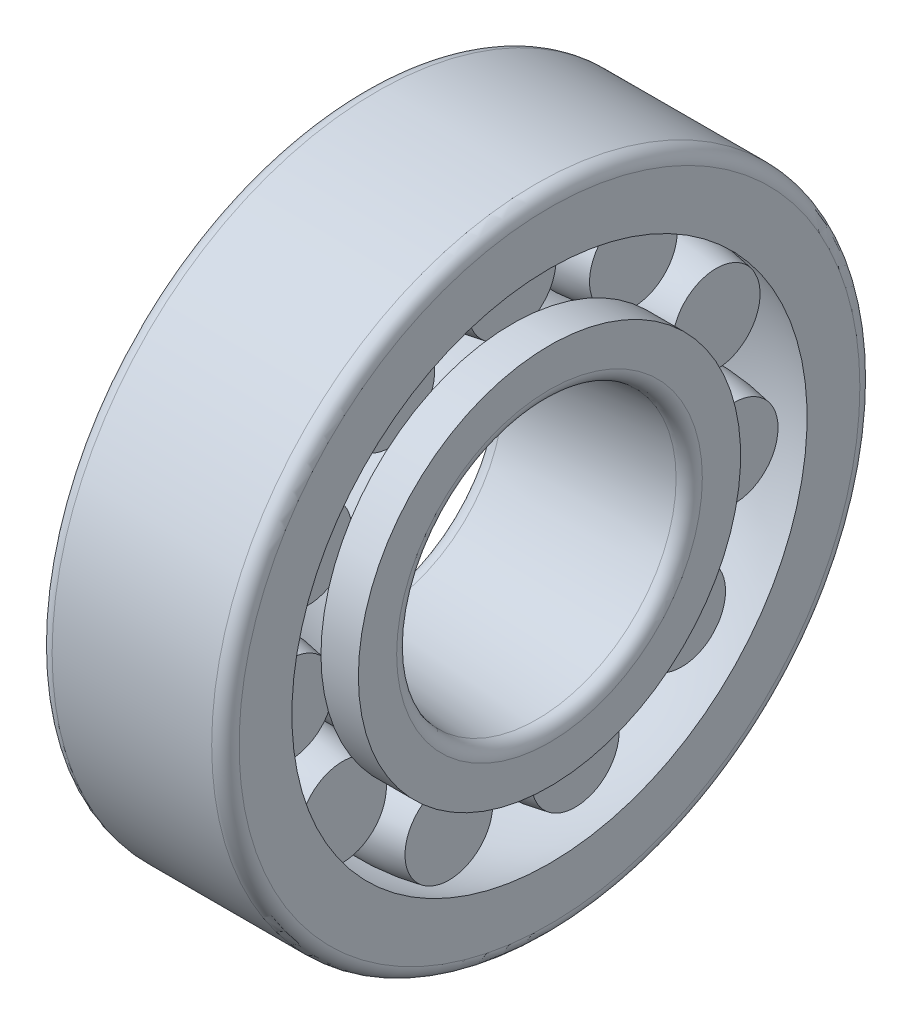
ISO-10303-21;
HEADER;
FILE_DESCRIPTION(('STEP AP214'),'2;1');
FILE_NAME('part.step','',(''),(''),'','','');
FILE_SCHEMA(('AUTOMOTIVE_DESIGN { 1 0 10303 214 1 1 1 1 }'));
ENDSEC;
DATA;
#1=APPLICATION_CONTEXT('core data for automotive mechanical design processes');
#2=APPLICATION_PROTOCOL_DEFINITION('international standard','automotive_design',2000,#1);
#3=PRODUCT_CONTEXT('',#1,'mechanical');
#4=PRODUCT('Part','Part','',(#3));
#5=PRODUCT_RELATED_PRODUCT_CATEGORY('part','',(#4));
#6=PRODUCT_DEFINITION_FORMATION('','',#4);
#7=PRODUCT_DEFINITION_CONTEXT('part definition',#1,'design');
#8=PRODUCT_DEFINITION('design','',#6,#7);
#9=PRODUCT_DEFINITION_SHAPE('','',#8);
#10=(LENGTH_UNIT() NAMED_UNIT(*) SI_UNIT(.MILLI.,.METRE.));
#11=(NAMED_UNIT(*) PLANE_ANGLE_UNIT() SI_UNIT($,.RADIAN.));
#12=(NAMED_UNIT(*) SI_UNIT($,.STERADIAN.) SOLID_ANGLE_UNIT());
#13=UNCERTAINTY_MEASURE_WITH_UNIT(LENGTH_MEASURE(1.E-05),#10,'distance_accuracy_value','');
#14=(GEOMETRIC_REPRESENTATION_CONTEXT(3) GLOBAL_UNCERTAINTY_ASSIGNED_CONTEXT((#13)) GLOBAL_UNIT_ASSIGNED_CONTEXT((#10,
#11,#12)) REPRESENTATION_CONTEXT('',''));
#15=CARTESIAN_POINT('',(0.,0.,0.));
#16=DIRECTION('',(0.,0.,1.));
#17=DIRECTION('',(1.,0.,0.));
#18=AXIS2_PLACEMENT_3D('',#15,#16,#17);
#19=CARTESIAN_POINT('',(3.00000000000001,12.1813372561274,-7.82847010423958));
#20=DIRECTION('',(1.,0.,0.));
#21=DIRECTION('',(0.,0.841253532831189,-0.540640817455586));
#22=AXIS2_PLACEMENT_3D('',#19,#20,#21);
#23=PLANE('',#22);
#24=CARTESIAN_POINT('',(3.00000000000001,15.1425635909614,-9.73153471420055));
#25=DIRECTION('',(1.,0.,0.));
#26=DIRECTION('',(0.,0.841253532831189,-0.540640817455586));
#27=AXIS2_PLACEMENT_3D('',#24,#25,#26);
#28=CIRCLE('',#27,3.52001652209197);
#29=CARTESIAN_POINT('',(3.00000000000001,18.1037899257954,-11.6345993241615));
#30=VERTEX_POINT('',#29);
#31=EDGE_CURVE('E11',#30,#30,#28,.T.);
#32=ORIENTED_EDGE('',*,*,#31,.F.);
#33=EDGE_LOOP('',(#32));
#34=FACE_BOUND('',#33,.T.);
#35=ADVANCED_FACE('F44',(#34),#23,.F.);
#36=CARTESIAN_POINT('',(7.5,15.1425635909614,-9.73153471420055));
#37=DIRECTION('',(1.,0.,0.));
#38=DIRECTION('',(0.,0.841253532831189,-0.540640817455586));
#39=AXIS2_PLACEMENT_3D('',#36,#37,#38);
#40=DEGENERATE_TOROIDAL_SURFACE('',#39,18.,21.9854750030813,.F.);
#41=CARTESIAN_POINT('',(12.,15.1425635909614,-9.73153471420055));
#42=DIRECTION('',(1.,0.,0.));
#43=DIRECTION('',(0.,0.841253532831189,-0.540640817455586));
#44=AXIS2_PLACEMENT_3D('',#41,#42,#43);
#45=CIRCLE('',#44,3.52001652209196);
#46=CARTESIAN_POINT('',(12.,18.1037899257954,-11.6345993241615));
#47=VERTEX_POINT('',#46);
#48=EDGE_CURVE('E50',#47,#47,#45,.T.);
#49=ORIENTED_EDGE('',*,*,#48,.F.);
#50=EDGE_LOOP('',(#49));
#51=FACE_BOUND('',#50,.T.);
#52=ORIENTED_EDGE('',*,*,#31,.T.);
#53=EDGE_LOOP('',(#52));
#54=FACE_BOUND('',#53,.T.);
#55=ADVANCED_FACE('F58',(#51,#54),#40,.F.);
#56=CARTESIAN_POINT('',(12.,12.1813372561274,-7.82847010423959));
#57=DIRECTION('',(-1.,0.,0.));
#58=DIRECTION('',(0.,-0.841253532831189,0.540640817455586));
#59=AXIS2_PLACEMENT_3D('',#56,#57,#58);
#60=PLANE('',#59);
#61=ORIENTED_EDGE('',*,*,#48,.T.);
#62=EDGE_LOOP('',(#61));
#63=FACE_BOUND('',#62,.T.);
#64=ADVANCED_FACE('F56',(#63),#60,.F.);
#65=CLOSED_SHELL('',(#35,#55,#64));
#66=MANIFOLD_SOLID_BREP('B2',#65);
#67=CARTESIAN_POINT('',(3.00000000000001,6.01520252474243,-13.1714562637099));
#68=DIRECTION('',(1.,0.,0.));
#69=DIRECTION('',(0.,0.415415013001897,-0.909631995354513));
#70=AXIS2_PLACEMENT_3D('',#67,#68,#69);
#71=PLANE('',#70);
#72=CARTESIAN_POINT('',(3.00000000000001,7.47747023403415,-16.3733759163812));
#73=DIRECTION('',(1.,0.,0.));
#74=DIRECTION('',(0.,0.415415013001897,-0.909631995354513));
#75=AXIS2_PLACEMENT_3D('',#72,#73,#74);
#76=CIRCLE('',#75,3.52001652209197);
#77=CARTESIAN_POINT('',(3.00000000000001,8.93973794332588,-19.5752955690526));
#78=VERTEX_POINT('',#77);
#79=EDGE_CURVE('E43',#78,#78,#76,.T.);
#80=ORIENTED_EDGE('',*,*,#79,.F.);
#81=EDGE_LOOP('',(#80));
#82=FACE_BOUND('',#81,.T.);
#83=ADVANCED_FACE('F99',(#82),#71,.F.);
#84=CARTESIAN_POINT('',(7.5,7.47747023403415,-16.3733759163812));
#85=DIRECTION('',(1.,0.,0.));
#86=DIRECTION('',(0.,0.415415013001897,-0.909631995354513));
#87=AXIS2_PLACEMENT_3D('',#84,#85,#86);
#88=DEGENERATE_TOROIDAL_SURFACE('',#87,18.,21.9854750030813,.F.);
#89=CARTESIAN_POINT('',(12.,7.47747023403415,-16.3733759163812));
#90=DIRECTION('',(1.,0.,0.));
#91=DIRECTION('',(0.,0.415415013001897,-0.909631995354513));
#92=AXIS2_PLACEMENT_3D('',#89,#90,#91);
#93=CIRCLE('',#92,3.52001652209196);
#94=CARTESIAN_POINT('',(12.,8.93973794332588,-19.5752955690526));
#95=VERTEX_POINT('',#94);
#96=EDGE_CURVE('E105',#95,#95,#93,.T.);
#97=ORIENTED_EDGE('',*,*,#96,.F.);
#98=EDGE_LOOP('',(#97));
#99=FACE_BOUND('',#98,.T.);
#100=ORIENTED_EDGE('',*,*,#79,.T.);
#101=EDGE_LOOP('',(#100));
#102=FACE_BOUND('',#101,.T.);
#103=ADVANCED_FACE('F113',(#99,#102),#88,.F.);
#104=CARTESIAN_POINT('',(12.,6.01520252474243,-13.1714562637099));
#105=DIRECTION('',(-1.,0.,0.));
#106=DIRECTION('',(0.,-0.415415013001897,0.909631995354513));
#107=AXIS2_PLACEMENT_3D('',#104,#105,#106);
#108=PLANE('',#107);
#109=ORIENTED_EDGE('',*,*,#96,.T.);
#110=EDGE_LOOP('',(#109));
#111=FACE_BOUND('',#110,.T.);
#112=ADVANCED_FACE('F111',(#111),#108,.F.);
#113=CLOSED_SHELL('',(#83,#103,#112));
#114=MANIFOLD_SOLID_BREP('B6',#113);
#115=CARTESIAN_POINT('',(3.00000000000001,-2.06071650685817,-14.332598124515));
#116=DIRECTION('',(1.,0.,0.));
#117=DIRECTION('',(0.,-0.142314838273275,-0.989821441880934));
#118=AXIS2_PLACEMENT_3D('',#115,#116,#117);
#119=PLANE('',#118);
#120=CARTESIAN_POINT('',(3.00000000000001,-2.56166708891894,-17.8167859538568));
#121=DIRECTION('',(1.,0.,0.));
#122=DIRECTION('',(0.,-0.142314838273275,-0.989821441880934));
#123=AXIS2_PLACEMENT_3D('',#120,#121,#122);
#124=CIRCLE('',#123,3.52001652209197);
#125=CARTESIAN_POINT('',(3.00000000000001,-3.06261767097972,-21.3009737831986));
#126=VERTEX_POINT('',#125);
#127=EDGE_CURVE('E98',#126,#126,#124,.T.);
#128=ORIENTED_EDGE('',*,*,#127,.F.);
#129=EDGE_LOOP('',(#128));
#130=FACE_BOUND('',#129,.T.);
#131=ADVANCED_FACE('F154',(#130),#119,.F.);
#132=CARTESIAN_POINT('',(7.5,-2.56166708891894,-17.8167859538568));
#133=DIRECTION('',(1.,0.,0.));
#134=DIRECTION('',(0.,-0.142314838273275,-0.989821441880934));
#135=AXIS2_PLACEMENT_3D('',#132,#133,#134);
#136=DEGENERATE_TOROIDAL_SURFACE('',#135,18.,21.9854750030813,.F.);
#137=CARTESIAN_POINT('',(12.,-2.56166708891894,-17.8167859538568));
#138=DIRECTION('',(1.,0.,0.));
#139=DIRECTION('',(0.,-0.142314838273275,-0.989821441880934));
#140=AXIS2_PLACEMENT_3D('',#137,#138,#139);
#141=CIRCLE('',#140,3.52001652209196);
#142=CARTESIAN_POINT('',(12.,-3.06261767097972,-21.3009737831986));
#143=VERTEX_POINT('',#142);
#144=EDGE_CURVE('E160',#143,#143,#141,.T.);
#145=ORIENTED_EDGE('',*,*,#144,.F.);
#146=EDGE_LOOP('',(#145));
#147=FACE_BOUND('',#146,.T.);
#148=ORIENTED_EDGE('',*,*,#127,.T.);
#149=EDGE_LOOP('',(#148));
#150=FACE_BOUND('',#149,.T.);
#151=ADVANCED_FACE('F168',(#147,#150),#136,.F.);
#152=CARTESIAN_POINT('',(12.,-2.06071650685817,-14.332598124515));
#153=DIRECTION('',(-1.,0.,0.));
#154=DIRECTION('',(0.,0.142314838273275,0.989821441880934));
#155=AXIS2_PLACEMENT_3D('',#152,#153,#154);
#156=PLANE('',#155);
#157=ORIENTED_EDGE('',*,*,#144,.T.);
#158=EDGE_LOOP('',(#157));
#159=FACE_BOUND('',#158,.T.);
#160=ADVANCED_FACE('F166',(#159),#156,.F.);
#161=CLOSED_SHELL('',(#131,#151,#160));
#162=MANIFOLD_SOLID_BREP('B38',#161);
#163=CARTESIAN_POINT('',(3.00000000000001,-9.48237260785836,-10.9432413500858));
#164=DIRECTION('',(1.,0.,0.));
#165=DIRECTION('',(0.,-0.654860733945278,-0.755749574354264));
#166=AXIS2_PLACEMENT_3D('',#163,#164,#165);
#167=PLANE('',#166);
#168=CARTESIAN_POINT('',(3.00000000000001,-11.787493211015,-13.6034923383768));
#169=DIRECTION('',(1.,0.,0.));
#170=DIRECTION('',(0.,-0.654860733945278,-0.755749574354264));
#171=AXIS2_PLACEMENT_3D('',#168,#169,#170);
#172=CIRCLE('',#171,3.52001652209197);
#173=CARTESIAN_POINT('',(3.00000000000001,-14.0926138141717,-16.2637433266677));
#174=VERTEX_POINT('',#173);
#175=EDGE_CURVE('E153',#174,#174,#172,.T.);
#176=ORIENTED_EDGE('',*,*,#175,.F.);
#177=EDGE_LOOP('',(#176));
#178=FACE_BOUND('',#177,.T.);
#179=ADVANCED_FACE('F209',(#178),#167,.F.);
#180=CARTESIAN_POINT('',(7.5,-11.787493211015,-13.6034923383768));
#181=DIRECTION('',(1.,0.,0.));
#182=DIRECTION('',(0.,-0.654860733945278,-0.755749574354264));
#183=AXIS2_PLACEMENT_3D('',#180,#181,#182);
#184=DEGENERATE_TOROIDAL_SURFACE('',#183,18.,21.9854750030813,.F.);
#185=CARTESIAN_POINT('',(12.,-11.787493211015,-13.6034923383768));
#186=DIRECTION('',(1.,0.,0.));
#187=DIRECTION('',(0.,-0.654860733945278,-0.755749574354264));
#188=AXIS2_PLACEMENT_3D('',#185,#186,#187);
#189=CIRCLE('',#188,3.52001652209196);
#190=CARTESIAN_POINT('',(12.,-14.0926138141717,-16.2637433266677));
#191=VERTEX_POINT('',#190);
#192=EDGE_CURVE('E215',#191,#191,#189,.T.);
#193=ORIENTED_EDGE('',*,*,#192,.F.);
#194=EDGE_LOOP('',(#193));
#195=FACE_BOUND('',#194,.T.);
#196=ORIENTED_EDGE('',*,*,#175,.T.);
#197=EDGE_LOOP('',(#196));
#198=FACE_BOUND('',#197,.T.);
#199=ADVANCED_FACE('F223',(#195,#198),#184,.F.);
#200=CARTESIAN_POINT('',(12.,-9.48237260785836,-10.9432413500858));
#201=DIRECTION('',(-1.,0.,0.));
#202=DIRECTION('',(0.,0.654860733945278,0.755749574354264));
#203=AXIS2_PLACEMENT_3D('',#200,#201,#202);
#204=PLANE('',#203);
#205=ORIENTED_EDGE('',*,*,#192,.T.);
#206=EDGE_LOOP('',(#205));
#207=FACE_BOUND('',#206,.T.);
#208=ADVANCED_FACE('F221',(#207),#204,.F.);
#209=CLOSED_SHELL('',(#179,#199,#208));
#210=MANIFOLD_SOLID_BREP('B93',#209);
#211=CARTESIAN_POINT('',(3.00000000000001,-13.8934424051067,-4.0794827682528));
#212=DIRECTION('',(1.,0.,0.));
#213=DIRECTION('',(0.,-0.959492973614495,-0.281732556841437));
#214=AXIS2_PLACEMENT_3D('',#211,#212,#213);
#215=PLANE('',#214);
#216=CARTESIAN_POINT('',(3.00000000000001,-17.2708735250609,-5.07118602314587));
#217=DIRECTION('',(1.,0.,0.));
#218=DIRECTION('',(0.,-0.959492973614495,-0.281732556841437));
#219=AXIS2_PLACEMENT_3D('',#216,#217,#218);
#220=CIRCLE('',#219,3.52001652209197);
#221=CARTESIAN_POINT('',(3.00000000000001,-20.6483046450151,-6.06288927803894));
#222=VERTEX_POINT('',#221);
#223=EDGE_CURVE('E208',#222,#222,#220,.T.);
#224=ORIENTED_EDGE('',*,*,#223,.F.);
#225=EDGE_LOOP('',(#224));
#226=FACE_BOUND('',#225,.T.);
#227=ADVANCED_FACE('F264',(#226),#215,.F.);
#228=CARTESIAN_POINT('',(7.5,-17.2708735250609,-5.07118602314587));
#229=DIRECTION('',(1.,0.,0.));
#230=DIRECTION('',(0.,-0.959492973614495,-0.281732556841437));
#231=AXIS2_PLACEMENT_3D('',#228,#229,#230);
#232=DEGENERATE_TOROIDAL_SURFACE('',#231,18.,21.9854750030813,.F.);
#233=CARTESIAN_POINT('',(12.,-17.2708735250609,-5.07118602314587));
#234=DIRECTION('',(1.,0.,0.));
#235=DIRECTION('',(0.,-0.959492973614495,-0.281732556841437));
#236=AXIS2_PLACEMENT_3D('',#233,#234,#235);
#237=CIRCLE('',#236,3.52001652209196);
#238=CARTESIAN_POINT('',(12.,-20.6483046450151,-6.06288927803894));
#239=VERTEX_POINT('',#238);
#240=EDGE_CURVE('E270',#239,#239,#237,.T.);
#241=ORIENTED_EDGE('',*,*,#240,.F.);
#242=EDGE_LOOP('',(#241));
#243=FACE_BOUND('',#242,.T.);
#244=ORIENTED_EDGE('',*,*,#223,.T.);
#245=EDGE_LOOP('',(#244));
#246=FACE_BOUND('',#245,.T.);
#247=ADVANCED_FACE('F278',(#243,#246),#232,.F.);
#248=CARTESIAN_POINT('',(12.,-13.8934424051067,-4.0794827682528));
#249=DIRECTION('',(-1.,0.,0.));
#250=DIRECTION('',(0.,0.959492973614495,0.281732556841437));
#251=AXIS2_PLACEMENT_3D('',#248,#249,#250);
#252=PLANE('',#251);
#253=ORIENTED_EDGE('',*,*,#240,.T.);
#254=EDGE_LOOP('',(#253));
#255=FACE_BOUND('',#254,.T.);
#256=ADVANCED_FACE('F276',(#255),#252,.F.);
#257=CLOSED_SHELL('',(#227,#247,#256));
#258=MANIFOLD_SOLID_BREP('B148',#257);
#259=CARTESIAN_POINT('',(3.00000000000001,-13.8934424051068,4.0794827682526));
#260=DIRECTION('',(1.,0.,0.));
#261=DIRECTION('',(0.,-0.959492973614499,0.281732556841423));
#262=AXIS2_PLACEMENT_3D('',#259,#260,#261);
#263=PLANE('',#262);
#264=CARTESIAN_POINT('',(3.00000000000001,-17.270873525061,5.07118602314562));
#265=DIRECTION('',(1.,0.,0.));
#266=DIRECTION('',(0.,-0.959492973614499,0.281732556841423));
#267=AXIS2_PLACEMENT_3D('',#264,#265,#266);
#268=CIRCLE('',#267,3.52001652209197);
#269=CARTESIAN_POINT('',(3.00000000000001,-20.6483046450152,6.06288927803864));
#270=VERTEX_POINT('',#269);
#271=EDGE_CURVE('E263',#270,#270,#268,.T.);
#272=ORIENTED_EDGE('',*,*,#271,.F.);
#273=EDGE_LOOP('',(#272));
#274=FACE_BOUND('',#273,.T.);
#275=ADVANCED_FACE('F319',(#274),#263,.F.);
#276=CARTESIAN_POINT('',(7.5,-17.270873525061,5.07118602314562));
#277=DIRECTION('',(1.,0.,0.));
#278=DIRECTION('',(0.,-0.959492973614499,0.281732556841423));
#279=AXIS2_PLACEMENT_3D('',#276,#277,#278);
#280=DEGENERATE_TOROIDAL_SURFACE('',#279,18.,21.9854750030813,.F.);
#281=CARTESIAN_POINT('',(12.,-17.270873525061,5.07118602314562));
#282=DIRECTION('',(1.,0.,0.));
#283=DIRECTION('',(0.,-0.959492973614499,0.281732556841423));
#284=AXIS2_PLACEMENT_3D('',#281,#282,#283);
#285=CIRCLE('',#284,3.52001652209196);
#286=CARTESIAN_POINT('',(12.,-20.6483046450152,6.06288927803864));
#287=VERTEX_POINT('',#286);
#288=EDGE_CURVE('E325',#287,#287,#285,.T.);
#289=ORIENTED_EDGE('',*,*,#288,.F.);
#290=EDGE_LOOP('',(#289));
#291=FACE_BOUND('',#290,.T.);
#292=ORIENTED_EDGE('',*,*,#271,.T.);
#293=EDGE_LOOP('',(#292));
#294=FACE_BOUND('',#293,.T.);
#295=ADVANCED_FACE('F333',(#291,#294),#280,.F.);
#296=CARTESIAN_POINT('',(12.,-13.8934424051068,4.0794827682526));
#297=DIRECTION('',(-1.,0.,0.));
#298=DIRECTION('',(0.,0.959492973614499,-0.281732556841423));
#299=AXIS2_PLACEMENT_3D('',#296,#297,#298);
#300=PLANE('',#299);
#301=ORIENTED_EDGE('',*,*,#288,.T.);
#302=EDGE_LOOP('',(#301));
#303=FACE_BOUND('',#302,.T.);
#304=ADVANCED_FACE('F331',(#303),#300,.F.);
#305=CLOSED_SHELL('',(#275,#295,#304));
#306=MANIFOLD_SOLID_BREP('B203',#305);
#307=CARTESIAN_POINT('',(3.00000000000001,-9.48237260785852,10.9432413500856));
#308=DIRECTION('',(1.,0.,0.));
#309=DIRECTION('',(0.,-0.654860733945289,0.755749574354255));
#310=AXIS2_PLACEMENT_3D('',#307,#308,#309);
#311=PLANE('',#310);
#312=CARTESIAN_POINT('',(3.00000000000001,-11.7874932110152,13.6034923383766));
#313=DIRECTION('',(1.,0.,0.));
#314=DIRECTION('',(0.,-0.654860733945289,0.755749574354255));
#315=AXIS2_PLACEMENT_3D('',#312,#313,#314);
#316=CIRCLE('',#315,3.52001652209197);
#317=CARTESIAN_POINT('',(3.00000000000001,-14.0926138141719,16.2637433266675));
#318=VERTEX_POINT('',#317);
#319=EDGE_CURVE('E318',#318,#318,#316,.T.);
#320=ORIENTED_EDGE('',*,*,#319,.F.);
#321=EDGE_LOOP('',(#320));
#322=FACE_BOUND('',#321,.T.);
#323=ADVANCED_FACE('F374',(#322),#311,.F.);
#324=CARTESIAN_POINT('',(7.5,-11.7874932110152,13.6034923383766));
#325=DIRECTION('',(1.,0.,0.));
#326=DIRECTION('',(0.,-0.654860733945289,0.755749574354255));
#327=AXIS2_PLACEMENT_3D('',#324,#325,#326);
#328=DEGENERATE_TOROIDAL_SURFACE('',#327,18.,21.9854750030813,.F.);
#329=CARTESIAN_POINT('',(12.,-11.7874932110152,13.6034923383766));
#330=DIRECTION('',(1.,0.,0.));
#331=DIRECTION('',(0.,-0.654860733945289,0.755749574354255));
#332=AXIS2_PLACEMENT_3D('',#329,#330,#331);
#333=CIRCLE('',#332,3.52001652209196);
#334=CARTESIAN_POINT('',(12.,-14.0926138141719,16.2637433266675));
#335=VERTEX_POINT('',#334);
#336=EDGE_CURVE('E380',#335,#335,#333,.T.);
#337=ORIENTED_EDGE('',*,*,#336,.F.);
#338=EDGE_LOOP('',(#337));
#339=FACE_BOUND('',#338,.T.);
#340=ORIENTED_EDGE('',*,*,#319,.T.);
#341=EDGE_LOOP('',(#340));
#342=FACE_BOUND('',#341,.T.);
#343=ADVANCED_FACE('F388',(#339,#342),#328,.F.);
#344=CARTESIAN_POINT('',(12.,-9.48237260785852,10.9432413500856));
#345=DIRECTION('',(-1.,0.,0.));
#346=DIRECTION('',(0.,0.654860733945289,-0.755749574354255));
#347=AXIS2_PLACEMENT_3D('',#344,#345,#346);
#348=PLANE('',#347);
#349=ORIENTED_EDGE('',*,*,#336,.T.);
#350=EDGE_LOOP('',(#349));
#351=FACE_BOUND('',#350,.T.);
#352=ADVANCED_FACE('F386',(#351),#348,.F.);
#353=CLOSED_SHELL('',(#323,#343,#352));
#354=MANIFOLD_SOLID_BREP('B258',#353);
#355=CARTESIAN_POINT('',(3.00000000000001,-2.06071650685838,14.332598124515));
#356=DIRECTION('',(1.,0.,0.));
#357=DIRECTION('',(0.,-0.142314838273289,0.989821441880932));
#358=AXIS2_PLACEMENT_3D('',#355,#356,#357);
#359=PLANE('',#358);
#360=CARTESIAN_POINT('',(3.00000000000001,-2.5616670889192,17.8167859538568));
#361=DIRECTION('',(1.,0.,0.));
#362=DIRECTION('',(0.,-0.142314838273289,0.989821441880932));
#363=AXIS2_PLACEMENT_3D('',#360,#361,#362);
#364=CIRCLE('',#363,3.52001652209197);
#365=CARTESIAN_POINT('',(3.00000000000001,-3.06261767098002,21.3009737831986));
#366=VERTEX_POINT('',#365);
#367=EDGE_CURVE('E373',#366,#366,#364,.T.);
#368=ORIENTED_EDGE('',*,*,#367,.F.);
#369=EDGE_LOOP('',(#368));
#370=FACE_BOUND('',#369,.T.);
#371=ADVANCED_FACE('F429',(#370),#359,.F.);
#372=CARTESIAN_POINT('',(7.5,-2.5616670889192,17.8167859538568));
#373=DIRECTION('',(1.,0.,0.));
#374=DIRECTION('',(0.,-0.142314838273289,0.989821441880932));
#375=AXIS2_PLACEMENT_3D('',#372,#373,#374);
#376=DEGENERATE_TOROIDAL_SURFACE('',#375,18.,21.9854750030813,.F.);
#377=CARTESIAN_POINT('',(12.,-2.5616670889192,17.8167859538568));
#378=DIRECTION('',(1.,0.,0.));
#379=DIRECTION('',(0.,-0.142314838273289,0.989821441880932));
#380=AXIS2_PLACEMENT_3D('',#377,#378,#379);
#381=CIRCLE('',#380,3.52001652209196);
#382=CARTESIAN_POINT('',(12.,-3.06261767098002,21.3009737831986));
#383=VERTEX_POINT('',#382);
#384=EDGE_CURVE('E435',#383,#383,#381,.T.);
#385=ORIENTED_EDGE('',*,*,#384,.F.);
#386=EDGE_LOOP('',(#385));
#387=FACE_BOUND('',#386,.T.);
#388=ORIENTED_EDGE('',*,*,#367,.T.);
#389=EDGE_LOOP('',(#388));
#390=FACE_BOUND('',#389,.T.);
#391=ADVANCED_FACE('F443',(#387,#390),#376,.F.);
#392=CARTESIAN_POINT('',(12.,-2.06071650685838,14.332598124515));
#393=DIRECTION('',(-1.,0.,0.));
#394=DIRECTION('',(0.,0.142314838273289,-0.989821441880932));
#395=AXIS2_PLACEMENT_3D('',#392,#393,#394);
#396=PLANE('',#395);
#397=ORIENTED_EDGE('',*,*,#384,.T.);
#398=EDGE_LOOP('',(#397));
#399=FACE_BOUND('',#398,.T.);
#400=ADVANCED_FACE('F441',(#399),#396,.F.);
#401=CLOSED_SHELL('',(#371,#391,#400));
#402=MANIFOLD_SOLID_BREP('B313',#401);
#403=CARTESIAN_POINT('',(3.00000000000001,6.01520252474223,13.17145626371));
#404=DIRECTION('',(1.,0.,0.));
#405=DIRECTION('',(0.,0.415415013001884,0.909631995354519));
#406=AXIS2_PLACEMENT_3D('',#403,#404,#405);
#407=PLANE('',#406);
#408=CARTESIAN_POINT('',(3.00000000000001,7.47747023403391,16.3733759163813));
#409=DIRECTION('',(1.,0.,0.));
#410=DIRECTION('',(0.,0.415415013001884,0.909631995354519));
#411=AXIS2_PLACEMENT_3D('',#408,#409,#410);
#412=CIRCLE('',#411,3.52001652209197);
#413=CARTESIAN_POINT('',(3.00000000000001,8.93973794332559,19.5752955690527));
#414=VERTEX_POINT('',#413);
#415=EDGE_CURVE('E428',#414,#414,#412,.T.);
#416=ORIENTED_EDGE('',*,*,#415,.F.);
#417=EDGE_LOOP('',(#416));
#418=FACE_BOUND('',#417,.T.);
#419=ADVANCED_FACE('F484',(#418),#407,.F.);
#420=CARTESIAN_POINT('',(7.5,7.47747023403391,16.3733759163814));
#421=DIRECTION('',(1.,0.,0.));
#422=DIRECTION('',(0.,0.415415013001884,0.909631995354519));
#423=AXIS2_PLACEMENT_3D('',#420,#421,#422);
#424=DEGENERATE_TOROIDAL_SURFACE('',#423,18.,21.9854750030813,.F.);
#425=CARTESIAN_POINT('',(12.,7.47747023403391,16.3733759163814));
#426=DIRECTION('',(1.,0.,0.));
#427=DIRECTION('',(0.,0.415415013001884,0.909631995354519));
#428=AXIS2_PLACEMENT_3D('',#425,#426,#427);
#429=CIRCLE('',#428,3.52001652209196);
#430=CARTESIAN_POINT('',(12.,8.93973794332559,19.5752955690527));
#431=VERTEX_POINT('',#430);
#432=EDGE_CURVE('E490',#431,#431,#429,.T.);
#433=ORIENTED_EDGE('',*,*,#432,.F.);
#434=EDGE_LOOP('',(#433));
#435=FACE_BOUND('',#434,.T.);
#436=ORIENTED_EDGE('',*,*,#415,.T.);
#437=EDGE_LOOP('',(#436));
#438=FACE_BOUND('',#437,.T.);
#439=ADVANCED_FACE('F498',(#435,#438),#424,.F.);
#440=CARTESIAN_POINT('',(12.,6.01520252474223,13.17145626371));
#441=DIRECTION('',(-1.,0.,0.));
#442=DIRECTION('',(0.,-0.415415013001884,-0.909631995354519));
#443=AXIS2_PLACEMENT_3D('',#440,#441,#442);
#444=PLANE('',#443);
#445=ORIENTED_EDGE('',*,*,#432,.T.);
#446=EDGE_LOOP('',(#445));
#447=FACE_BOUND('',#446,.T.);
#448=ADVANCED_FACE('F496',(#447),#444,.F.);
#449=CLOSED_SHELL('',(#419,#439,#448));
#450=MANIFOLD_SOLID_BREP('B368',#449);
#451=CARTESIAN_POINT('',(3.00000000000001,12.1813372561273,7.82847010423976));
#452=DIRECTION('',(1.,0.,0.));
#453=DIRECTION('',(0.,0.841253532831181,0.540640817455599));
#454=AXIS2_PLACEMENT_3D('',#451,#452,#453);
#455=PLANE('',#454);
#456=CARTESIAN_POINT('',(3.00000000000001,15.1425635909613,9.73153471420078));
#457=DIRECTION('',(1.,0.,0.));
#458=DIRECTION('',(0.,0.841253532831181,0.540640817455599));
#459=AXIS2_PLACEMENT_3D('',#456,#457,#458);
#460=CIRCLE('',#459,3.52001652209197);
#461=CARTESIAN_POINT('',(3.00000000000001,18.1037899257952,11.6345993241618));
#462=VERTEX_POINT('',#461);
#463=EDGE_CURVE('E483',#462,#462,#460,.T.);
#464=ORIENTED_EDGE('',*,*,#463,.F.);
#465=EDGE_LOOP('',(#464));
#466=FACE_BOUND('',#465,.T.);
#467=ADVANCED_FACE('F539',(#466),#455,.F.);
#468=CARTESIAN_POINT('',(7.5,15.1425635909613,9.73153471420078));
#469=DIRECTION('',(1.,0.,0.));
#470=DIRECTION('',(0.,0.841253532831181,0.540640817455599));
#471=AXIS2_PLACEMENT_3D('',#468,#469,#470);
#472=DEGENERATE_TOROIDAL_SURFACE('',#471,18.,21.9854750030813,.F.);
#473=CARTESIAN_POINT('',(12.,15.1425635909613,9.73153471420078));
#474=DIRECTION('',(1.,0.,0.));
#475=DIRECTION('',(0.,0.841253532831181,0.540640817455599));
#476=AXIS2_PLACEMENT_3D('',#473,#474,#475);
#477=CIRCLE('',#476,3.52001652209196);
#478=CARTESIAN_POINT('',(12.,18.1037899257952,11.6345993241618));
#479=VERTEX_POINT('',#478);
#480=EDGE_CURVE('E545',#479,#479,#477,.T.);
#481=ORIENTED_EDGE('',*,*,#480,.F.);
#482=EDGE_LOOP('',(#481));
#483=FACE_BOUND('',#482,.T.);
#484=ORIENTED_EDGE('',*,*,#463,.T.);
#485=EDGE_LOOP('',(#484));
#486=FACE_BOUND('',#485,.T.);
#487=ADVANCED_FACE('F553',(#483,#486),#472,.F.);
#488=CARTESIAN_POINT('',(12.,12.1813372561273,7.82847010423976));
#489=DIRECTION('',(-1.,0.,0.));
#490=DIRECTION('',(0.,-0.841253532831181,-0.540640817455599));
#491=AXIS2_PLACEMENT_3D('',#488,#489,#490);
#492=PLANE('',#491);
#493=ORIENTED_EDGE('',*,*,#480,.T.);
#494=EDGE_LOOP('',(#493));
#495=FACE_BOUND('',#494,.T.);
#496=ADVANCED_FACE('F551',(#495),#492,.F.);
#497=CLOSED_SHELL('',(#467,#487,#496));
#498=MANIFOLD_SOLID_BREP('B423',#497);
#499=CARTESIAN_POINT('',(3.00000000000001,14.479983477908,0.));
#500=DIRECTION('',(1.,0.,0.));
#501=DIRECTION('',(0.,1.,0.));
#502=AXIS2_PLACEMENT_3D('',#499,#500,#501);
#503=PLANE('',#502);
#504=CARTESIAN_POINT('',(3.00000000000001,18.,0.));
#505=DIRECTION('',(1.,0.,0.));
#506=DIRECTION('',(0.,1.,0.));
#507=AXIS2_PLACEMENT_3D('',#504,#505,#506);
#508=CIRCLE('',#507,3.52001652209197);
#509=CARTESIAN_POINT('',(3.00000000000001,21.520016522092,0.));
#510=VERTEX_POINT('',#509);
#511=EDGE_CURVE('E538',#510,#510,#508,.T.);
#512=ORIENTED_EDGE('',*,*,#511,.F.);
#513=EDGE_LOOP('',(#512));
#514=FACE_BOUND('',#513,.T.);
#515=ADVANCED_FACE('F594',(#514),#503,.F.);
#516=CARTESIAN_POINT('',(7.5,18.,0.));
#517=DIRECTION('',(1.,0.,0.));
#518=DIRECTION('',(0.,1.,0.));
#519=AXIS2_PLACEMENT_3D('',#516,#517,#518);
#520=DEGENERATE_TOROIDAL_SURFACE('',#519,18.,21.9854750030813,.F.);
#521=CARTESIAN_POINT('',(12.,18.,0.));
#522=DIRECTION('',(1.,0.,0.));
#523=DIRECTION('',(0.,1.,0.));
#524=AXIS2_PLACEMENT_3D('',#521,#522,#523);
#525=CIRCLE('',#524,3.52001652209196);
#526=CARTESIAN_POINT('',(12.,21.520016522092,0.));
#527=VERTEX_POINT('',#526);
#528=EDGE_CURVE('E600',#527,#527,#525,.T.);
#529=ORIENTED_EDGE('',*,*,#528,.F.);
#530=EDGE_LOOP('',(#529));
#531=FACE_BOUND('',#530,.T.);
#532=ORIENTED_EDGE('',*,*,#511,.T.);
#533=EDGE_LOOP('',(#532));
#534=FACE_BOUND('',#533,.T.);
#535=ADVANCED_FACE('F608',(#531,#534),#520,.F.);
#536=CARTESIAN_POINT('',(12.,14.479983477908,0.));
#537=DIRECTION('',(-1.,0.,0.));
#538=DIRECTION('',(0.,-1.,0.));
#539=AXIS2_PLACEMENT_3D('',#536,#537,#538);
#540=PLANE('',#539);
#541=ORIENTED_EDGE('',*,*,#528,.T.);
#542=EDGE_LOOP('',(#541));
#543=FACE_BOUND('',#542,.T.);
#544=ADVANCED_FACE('F606',(#543),#540,.F.);
#545=CLOSED_SHELL('',(#515,#535,#544));
#546=MANIFOLD_SOLID_BREP('B478',#545);
#547=CARTESIAN_POINT('',(7.5,0.,0.));
#548=DIRECTION('',(-1.,0.,0.));
#549=DIRECTION('',(0.,0.,1.));
#550=AXIS2_PLACEMENT_3D('',#547,#548,#549);
#551=TOROIDAL_SURFACE('',#550,36.,21.9854750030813);
#552=CARTESIAN_POINT('',(12.,0.,0.));
#553=DIRECTION('',(-1.,0.,0.));
#554=DIRECTION('',(0.,0.,1.));
#555=AXIS2_PLACEMENT_3D('',#552,#553,#554);
#556=CIRCLE('',#555,14.479983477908);
#557=CARTESIAN_POINT('',(12.,0.,14.479983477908));
#558=VERTEX_POINT('',#557);
#559=EDGE_CURVE('E677',#558,#558,#556,.T.);
#560=ORIENTED_EDGE('',*,*,#559,.T.);
#561=EDGE_LOOP('',(#560));
#562=FACE_BOUND('',#561,.T.);
#563=CARTESIAN_POINT('',(3.,0.,0.));
#564=DIRECTION('',(-1.,0.,0.));
#565=DIRECTION('',(0.,0.,1.));
#566=AXIS2_PLACEMENT_3D('',#563,#564,#565);
#567=CIRCLE('',#566,14.479983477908);
#568=CARTESIAN_POINT('',(3.,0.,14.479983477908));
#569=VERTEX_POINT('',#568);
#570=EDGE_CURVE('E662',#569,#569,#567,.T.);
#571=ORIENTED_EDGE('',*,*,#570,.F.);
#572=EDGE_LOOP('',(#571));
#573=FACE_BOUND('',#572,.T.);
#574=ADVANCED_FACE('F642',(#562,#573),#551,.F.);
#575=CARTESIAN_POINT('',(3.,0.,0.));
#576=DIRECTION('',(1.,0.,0.));
#577=DIRECTION('',(0.,0.,-1.));
#578=AXIS2_PLACEMENT_3D('',#575,#576,#577);
#579=PLANE('',#578);
#580=ORIENTED_EDGE('',*,*,#570,.T.);
#581=EDGE_LOOP('',(#580));
#582=FACE_BOUND('',#581,.T.);
#583=CARTESIAN_POINT('',(3.,0.,0.));
#584=DIRECTION('',(-1.,0.,0.));
#585=DIRECTION('',(0.,0.,1.));
#586=AXIS2_PLACEMENT_3D('',#583,#584,#585);
#587=CIRCLE('',#586,15.3333333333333);
#588=CARTESIAN_POINT('',(3.,0.,15.3333333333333));
#589=VERTEX_POINT('',#588);
#590=EDGE_CURVE('E665',#589,#589,#587,.T.);
#591=ORIENTED_EDGE('',*,*,#590,.F.);
#592=EDGE_LOOP('',(#591));
#593=FACE_BOUND('',#592,.T.);
#594=ADVANCED_FACE('F701',(#582,#593),#579,.T.);
#595=CARTESIAN_POINT('',(0.,0.,0.));
#596=DIRECTION('',(-1.,0.,0.));
#597=DIRECTION('',(0.,0.,1.));
#598=AXIS2_PLACEMENT_3D('',#595,#596,#597);
#599=CYLINDRICAL_SURFACE('',#598,15.3333333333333);
#600=ORIENTED_EDGE('',*,*,#590,.T.);
#601=EDGE_LOOP('',(#600));
#602=FACE_BOUND('',#601,.T.);
#603=CARTESIAN_POINT('',(0.,0.,0.));
#604=DIRECTION('',(-1.,0.,0.));
#605=DIRECTION('',(0.,0.,1.));
#606=AXIS2_PLACEMENT_3D('',#603,#604,#605);
#607=CIRCLE('',#606,15.3333333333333);
#608=CARTESIAN_POINT('',(0.,0.,15.3333333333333));
#609=VERTEX_POINT('',#608);
#610=EDGE_CURVE('E668',#609,#609,#607,.T.);
#611=ORIENTED_EDGE('',*,*,#610,.F.);
#612=EDGE_LOOP('',(#611));
#613=FACE_BOUND('',#612,.T.);
#614=ADVANCED_FACE('F706',(#602,#613),#599,.T.);
#615=CARTESIAN_POINT('',(0.,0.,0.));
#616=DIRECTION('',(-1.,0.,0.));
#617=DIRECTION('',(0.,0.,1.));
#618=AXIS2_PLACEMENT_3D('',#615,#616,#617);
#619=PLANE('',#618);
#620=CARTESIAN_POINT('',(0.,0.,0.));
#621=DIRECTION('',(-1.,0.,0.));
#622=DIRECTION('',(0.,0.,1.));
#623=AXIS2_PLACEMENT_3D('',#620,#621,#622);
#624=CIRCLE('',#623,11.195479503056);
#625=CARTESIAN_POINT('',(0.,0.,11.195479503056));
#626=VERTEX_POINT('',#625);
#627=EDGE_CURVE('E649',#626,#626,#624,.F.);
#628=ORIENTED_EDGE('',*,*,#627,.T.);
#629=EDGE_LOOP('',(#628));
#630=FACE_BOUND('',#629,.T.);
#631=ORIENTED_EDGE('',*,*,#610,.T.);
#632=EDGE_LOOP('',(#631));
#633=FACE_BOUND('',#632,.T.);
#634=ADVANCED_FACE('F712',(#630,#633),#619,.T.);
#635=CARTESIAN_POINT('',(0.,0.,0.));
#636=DIRECTION('',(1.,0.,0.));
#637=DIRECTION('',(0.,0.,1.));
#638=AXIS2_PLACEMENT_3D('',#635,#636,#637);
#639=CONICAL_SURFACE('',#638,10.,0.0831412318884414);
#640=CARTESIAN_POINT('',(1.19135002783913,0.,0.));
#641=DIRECTION('',(-1.,0.,0.));
#642=DIRECTION('',(0.,0.,1.));
#643=AXIS2_PLACEMENT_3D('',#640,#641,#642);
#644=CIRCLE('',#643,10.0992791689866);
#645=CARTESIAN_POINT('',(1.19135002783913,0.,10.0992791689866));
#646=VERTEX_POINT('',#645);
#647=EDGE_CURVE('E653',#646,#646,#644,.T.);
#648=ORIENTED_EDGE('',*,*,#647,.T.);
#649=EDGE_LOOP('',(#648));
#650=FACE_BOUND('',#649,.T.);
#651=CARTESIAN_POINT('',(13.9913500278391,0.,0.));
#652=DIRECTION('',(-1.,0.,0.));
#653=DIRECTION('',(0.,0.,1.));
#654=AXIS2_PLACEMENT_3D('',#651,#652,#653);
#655=CIRCLE('',#654,11.1659458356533);
#656=CARTESIAN_POINT('',(13.9913500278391,0.,11.1659458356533));
#657=VERTEX_POINT('',#656);
#658=EDGE_CURVE('E657',#657,#657,#655,.F.);
#659=ORIENTED_EDGE('',*,*,#658,.T.);
#660=EDGE_LOOP('',(#659));
#661=FACE_BOUND('',#660,.T.);
#662=ADVANCED_FACE('F698',(#650,#661),#639,.F.);
#663=CARTESIAN_POINT('',(15.,0.,0.));
#664=DIRECTION('',(1.,0.,0.));
#665=DIRECTION('',(0.,0.,-1.));
#666=AXIS2_PLACEMENT_3D('',#663,#664,#665);
#667=PLANE('',#666);
#668=CARTESIAN_POINT('',(15.,0.,0.));
#669=DIRECTION('',(1.,0.,0.));
#670=DIRECTION('',(0.,0.,-1.));
#671=AXIS2_PLACEMENT_3D('',#668,#669,#670);
#672=CIRCLE('',#671,12.2621461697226);
#673=CARTESIAN_POINT('',(15.,0.,-12.2621461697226));
#674=VERTEX_POINT('',#673);
#675=EDGE_CURVE('E593',#674,#674,#672,.F.);
#676=ORIENTED_EDGE('',*,*,#675,.T.);
#677=EDGE_LOOP('',(#676));
#678=FACE_BOUND('',#677,.T.);
#679=CARTESIAN_POINT('',(15.,0.,0.));
#680=DIRECTION('',(-1.,0.,0.));
#681=DIRECTION('',(0.,0.,1.));
#682=AXIS2_PLACEMENT_3D('',#679,#680,#681);
#683=CIRCLE('',#682,15.3333333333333);
#684=CARTESIAN_POINT('',(15.,0.,15.3333333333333));
#685=VERTEX_POINT('',#684);
#686=EDGE_CURVE('E671',#685,#685,#683,.T.);
#687=ORIENTED_EDGE('',*,*,#686,.F.);
#688=EDGE_LOOP('',(#687));
#689=FACE_BOUND('',#688,.T.);
#690=ADVANCED_FACE('F692',(#678,#689),#667,.T.);
#691=CARTESIAN_POINT('',(0.,0.,0.));
#692=DIRECTION('',(-1.,0.,0.));
#693=DIRECTION('',(0.,0.,1.));
#694=AXIS2_PLACEMENT_3D('',#691,#692,#693);
#695=CYLINDRICAL_SURFACE('',#694,15.3333333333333);
#696=ORIENTED_EDGE('',*,*,#686,.T.);
#697=EDGE_LOOP('',(#696));
#698=FACE_BOUND('',#697,.T.);
#699=CARTESIAN_POINT('',(12.,0.,0.));
#700=DIRECTION('',(-1.,0.,0.));
#701=DIRECTION('',(0.,0.,1.));
#702=AXIS2_PLACEMENT_3D('',#699,#700,#701);
#703=CIRCLE('',#702,15.3333333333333);
#704=CARTESIAN_POINT('',(12.,0.,15.3333333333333));
#705=VERTEX_POINT('',#704);
#706=EDGE_CURVE('E674',#705,#705,#703,.T.);
#707=ORIENTED_EDGE('',*,*,#706,.F.);
#708=EDGE_LOOP('',(#707));
#709=FACE_BOUND('',#708,.T.);
#710=ADVANCED_FACE('F687',(#698,#709),#695,.T.);
#711=CARTESIAN_POINT('',(12.,0.,0.));
#712=DIRECTION('',(1.,0.,0.));
#713=DIRECTION('',(0.,0.,-1.));
#714=AXIS2_PLACEMENT_3D('',#711,#712,#713);
#715=PLANE('',#714);
#716=ORIENTED_EDGE('',*,*,#559,.F.);
#717=EDGE_LOOP('',(#716));
#718=FACE_BOUND('',#717,.T.);
#719=ORIENTED_EDGE('',*,*,#706,.T.);
#720=EDGE_LOOP('',(#719));
#721=FACE_BOUND('',#720,.T.);
#722=ADVANCED_FACE('F683',(#718,#721),#715,.F.);
#723=CARTESIAN_POINT('',(1.1,0.,0.));
#724=DIRECTION('',(-1.,0.,0.));
#725=DIRECTION('',(0.,0.,1.));
#726=AXIS2_PLACEMENT_3D('',#723,#724,#725);
#727=TOROIDAL_SURFACE('',#726,11.195479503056,1.1);
#728=ORIENTED_EDGE('',*,*,#627,.F.);
#729=EDGE_LOOP('',(#728));
#730=FACE_BOUND('',#729,.T.);
#731=ORIENTED_EDGE('',*,*,#647,.F.);
#732=EDGE_LOOP('',(#731));
#733=FACE_BOUND('',#732,.T.);
#734=ADVANCED_FACE('F686',(#730,#733),#727,.T.);
#735=CARTESIAN_POINT('',(13.9,0.,0.));
#736=DIRECTION('',(1.,0.,0.));
#737=DIRECTION('',(0.,0.,-1.));
#738=AXIS2_PLACEMENT_3D('',#735,#736,#737);
#739=TOROIDAL_SURFACE('',#738,12.2621461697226,1.1);
#740=ORIENTED_EDGE('',*,*,#658,.F.);
#741=EDGE_LOOP('',(#740));
#742=FACE_BOUND('',#741,.T.);
#743=ORIENTED_EDGE('',*,*,#675,.F.);
#744=EDGE_LOOP('',(#743));
#745=FACE_BOUND('',#744,.T.);
#746=ADVANCED_FACE('F644',(#742,#745),#739,.T.);
#747=CLOSED_SHELL('',(#574,#594,#614,#634,#662,#690,#710,#722,#734,#746));
#748=MANIFOLD_SOLID_BREP('B533',#747);
#749=CARTESIAN_POINT('',(0.,0.,0.));
#750=DIRECTION('',(-1.,0.,0.));
#751=DIRECTION('',(0.,0.,1.));
#752=AXIS2_PLACEMENT_3D('',#749,#750,#751);
#753=PLANE('',#752);
#754=CARTESIAN_POINT('',(0.,0.,0.));
#755=DIRECTION('',(-1.,0.,0.));
#756=DIRECTION('',(0.,0.,1.));
#757=AXIS2_PLACEMENT_3D('',#754,#755,#756);
#758=CIRCLE('',#757,24.9);
#759=CARTESIAN_POINT('',(0.,0.,24.9));
#760=VERTEX_POINT('',#759);
#761=EDGE_CURVE('E641',#760,#760,#758,.T.);
#762=ORIENTED_EDGE('',*,*,#761,.T.);
#763=EDGE_LOOP('',(#762));
#764=FACE_BOUND('',#763,.T.);
#765=CARTESIAN_POINT('',(0.,0.,0.));
#766=DIRECTION('',(-1.,0.,0.));
#767=DIRECTION('',(0.,0.,1.));
#768=AXIS2_PLACEMENT_3D('',#765,#766,#767);
#769=CIRCLE('',#768,20.6666666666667);
#770=CARTESIAN_POINT('',(0.,20.6666666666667,0.));
#771=VERTEX_POINT('',#770);
#772=EDGE_CURVE('E814',#771,#771,#769,.T.);
#773=ORIENTED_EDGE('',*,*,#772,.F.);
#774=EDGE_LOOP('',(#773));
#775=FACE_BOUND('',#774,.T.);
#776=ADVANCED_FACE('F794',(#764,#775),#753,.T.);
#777=CARTESIAN_POINT('',(7.5,0.,0.));
#778=DIRECTION('',(-1.,0.,0.));
#779=DIRECTION('',(0.,1.,0.));
#780=AXIS2_PLACEMENT_3D('',#777,#778,#779);
#781=SPHERICAL_SURFACE('',#780,21.9854750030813);
#782=CARTESIAN_POINT('',(15.,0.,0.));
#783=DIRECTION('',(-1.,0.,0.));
#784=DIRECTION('',(0.,0.,1.));
#785=AXIS2_PLACEMENT_3D('',#782,#783,#784);
#786=CIRCLE('',#785,20.6666666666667);
#787=CARTESIAN_POINT('',(15.,20.6666666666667,0.));
#788=VERTEX_POINT('',#787);
#789=EDGE_CURVE('E817',#788,#788,#786,.T.);
#790=CARTESIAN_POINT('',(15.,20.6666666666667,0.));
#791=CARTESIAN_POINT('',(14.8501136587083,20.7210612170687,0.));
#792=CARTESIAN_POINT('',(14.6996353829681,20.7738246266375,0.));
#793=CARTESIAN_POINT('',(14.3975666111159,20.8760654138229,0.));
#794=CARTESIAN_POINT('',(14.2459761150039,20.9255427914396,0.));
#795=CARTESIAN_POINT('',(13.9417545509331,21.0211877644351,0.));
#796=CARTESIAN_POINT('',(13.7891234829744,21.067355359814,0.));
#797=CARTESIAN_POINT('',(13.4828930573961,21.156359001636,0.));
#798=CARTESIAN_POINT('',(13.3292936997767,21.199195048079,0.));
#799=CARTESIAN_POINT('',(13.02119939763,21.2815152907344,0.));
#800=CARTESIAN_POINT('',(12.8667044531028,21.3209994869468,0.));
#801=CARTESIAN_POINT('',(12.5568921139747,21.3965973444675,0.));
#802=CARTESIAN_POINT('',(12.4015747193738,21.4327110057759,0.));
#803=CARTESIAN_POINT('',(12.0901910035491,21.5015506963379,0.));
#804=CARTESIAN_POINT('',(11.9341246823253,21.5342767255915,0.));
#805=CARTESIAN_POINT('',(11.6213169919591,21.5963256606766,0.));
#806=CARTESIAN_POINT('',(11.4645756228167,21.625648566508,0.));
#807=CARTESIAN_POINT('',(11.1504920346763,21.6808773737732,0.));
#808=CARTESIAN_POINT('',(10.9931498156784,21.7067832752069,0.));
#809=CARTESIAN_POINT('',(10.677939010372,21.7551658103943,0.));
#810=CARTESIAN_POINT('',(10.5200704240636,21.777642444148,0.));
#811=CARTESIAN_POINT('',(10.2038816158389,21.8191558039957,0.));
#812=CARTESIAN_POINT('',(10.0455613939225,21.8381925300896,0.));
#813=CARTESIAN_POINT('',(9.7285442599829,21.87281706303,0.));
#814=CARTESIAN_POINT('',(9.56984734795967,21.8884048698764,0.));
#815=CARTESIAN_POINT('',(9.2521519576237,21.9161241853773,0.));
#816=CARTESIAN_POINT('',(9.09315347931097,21.9282556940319,0.));
#817=CARTESIAN_POINT('',(8.77493022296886,21.9490566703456,0.));
#818=CARTESIAN_POINT('',(8.61570544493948,21.9577261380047,0.));
#819=CARTESIAN_POINT('',(8.29710496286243,21.9715989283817,0.));
#820=CARTESIAN_POINT('',(8.13772925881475,21.9768022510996,0.));
#821=CARTESIAN_POINT('',(7.81890236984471,21.9837402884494,0.));
#822=CARTESIAN_POINT('',(7.65945118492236,21.9854750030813,0.));
#823=CARTESIAN_POINT('',(7.34054881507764,21.9854750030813,0.));
#824=CARTESIAN_POINT('',(7.18109763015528,21.9837402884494,0.));
#825=CARTESIAN_POINT('',(6.86227074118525,21.9768022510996,0.));
#826=CARTESIAN_POINT('',(6.70289503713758,21.9715989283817,0.));
#827=CARTESIAN_POINT('',(6.38429455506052,21.9577261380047,0.));
#828=CARTESIAN_POINT('',(6.22506977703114,21.9490566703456,0.));
#829=CARTESIAN_POINT('',(5.90684652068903,21.9282556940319,0.));
#830=CARTESIAN_POINT('',(5.7478480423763,21.9161241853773,0.));
#831=CARTESIAN_POINT('',(5.43015265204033,21.8884048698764,0.));
#832=CARTESIAN_POINT('',(5.2714557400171,21.87281706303,0.));
#833=CARTESIAN_POINT('',(4.9544386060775,21.8381925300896,0.));
#834=CARTESIAN_POINT('',(4.79611838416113,21.8191558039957,0.));
#835=CARTESIAN_POINT('',(4.47992957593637,21.777642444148,0.));
#836=CARTESIAN_POINT('',(4.32206098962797,21.7551658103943,0.));
#837=CARTESIAN_POINT('',(4.00685018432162,21.7067832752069,0.));
#838=CARTESIAN_POINT('',(3.84950796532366,21.6808773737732,0.));
#839=CARTESIAN_POINT('',(3.53542437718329,21.625648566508,0.));
#840=CARTESIAN_POINT('',(3.37868300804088,21.5963256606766,0.));
#841=CARTESIAN_POINT('',(3.06587531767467,21.5342767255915,0.));
#842=CARTESIAN_POINT('',(2.90980899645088,21.5015506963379,0.));
#843=CARTESIAN_POINT('',(2.5984252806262,21.4327110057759,0.));
#844=CARTESIAN_POINT('',(2.44310788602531,21.3965973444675,0.));
#845=CARTESIAN_POINT('',(2.13329554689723,21.3209994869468,0.));
#846=CARTESIAN_POINT('',(1.97880060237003,21.2815152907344,0.));
#847=CARTESIAN_POINT('',(1.67070630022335,21.199195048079,0.));
#848=CARTESIAN_POINT('',(1.51710694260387,21.156359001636,0.));
#849=CARTESIAN_POINT('',(1.21087651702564,21.067355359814,0.));
#850=CARTESIAN_POINT('',(1.05824544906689,21.0211877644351,0.));
#851=CARTESIAN_POINT('',(0.754023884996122,20.9255427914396,0.));
#852=CARTESIAN_POINT('',(0.602433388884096,20.8760654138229,0.));
#853=CARTESIAN_POINT('',(0.300364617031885,20.7738246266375,0.));
#854=CARTESIAN_POINT('',(0.149886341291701,20.7210612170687,0.));
#855=CARTESIAN_POINT('',(0.,20.6666666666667,0.));
#856=B_SPLINE_CURVE_WITH_KNOTS('',3,(#790,#791,#792,#793,#794,#795,#796,#797,#798,#799,#800,
#801,#802,#803,#804,#805,#806,#807,#808,#809,#810,#811,#812,#813,#814,#815,#816,#817,#818,#819,
#820,#821,#822,#823,#824,#825,#826,#827,#828,#829,#830,#831,#832,#833,#834,#835,#836,#837,#838,
#839,#840,#841,#842,#843,#844,#845,#846,#847,#848,#849,#850,#851,#852,#853,#854,#855),
.UNSPECIFIED.,.F.,.F.,(4,2,2,2,2,2,2,2,2,2,2,2,2,2,2,2,2,2,2,2,2,2,2,2,2,2,2,2,2,2,2,2,4),(0.,
0.478344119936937,0.956688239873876,1.43503235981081,1.91337647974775,2.39172059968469,
2.87006471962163,3.34840883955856,3.8267529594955,4.30509707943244,4.78344119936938,
5.26178531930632,5.74012943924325,6.21847355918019,6.69681767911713,7.17516179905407,
7.65350591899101,8.13185003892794,8.61019415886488,9.08853827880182,9.56688239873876,
10.0452265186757,10.5235706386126,11.0019147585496,11.4802588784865,11.9586029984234,
12.4369471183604,12.9152912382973,13.3936353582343,13.8719794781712,14.3503235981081,
14.8286677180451,15.307011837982),.UNSPECIFIED.);
#857=EDGE_CURVE('BSEAM823',#788,#771,#856,.T.);
#858=ORIENTED_EDGE('',*,*,#789,.F.);
#859=ORIENTED_EDGE('',*,*,#772,.T.);
#860=ORIENTED_EDGE('',*,*,#857,.T.);
#861=ORIENTED_EDGE('',*,*,#857,.F.);
#862=EDGE_LOOP('',(#858,#860,#859,#861));
#863=FACE_BOUND('',#862,.T.);
#864=ADVANCED_FACE('F823',(#863),#781,.F.);
#865=CARTESIAN_POINT('',(15.,0.,0.));
#866=DIRECTION('',(1.,0.,0.));
#867=DIRECTION('',(0.,0.,-1.));
#868=AXIS2_PLACEMENT_3D('',#865,#866,#867);
#869=PLANE('',#868);
#870=CARTESIAN_POINT('',(15.,0.,0.));
#871=DIRECTION('',(1.,0.,0.));
#872=DIRECTION('',(0.,0.,-1.));
#873=AXIS2_PLACEMENT_3D('',#870,#871,#872);
#874=CIRCLE('',#873,24.9);
#875=CARTESIAN_POINT('',(15.,0.,-24.9));
#876=VERTEX_POINT('',#875);
#877=EDGE_CURVE('E801',#876,#876,#874,.T.);
#878=ORIENTED_EDGE('',*,*,#877,.T.);
#879=EDGE_LOOP('',(#878));
#880=FACE_BOUND('',#879,.T.);
#881=ORIENTED_EDGE('',*,*,#789,.T.);
#882=EDGE_LOOP('',(#881));
#883=FACE_BOUND('',#882,.T.);
#884=ADVANCED_FACE('F821',(#880,#883),#869,.T.);
#885=CARTESIAN_POINT('',(0.,0.,0.));
#886=DIRECTION('',(-1.,0.,0.));
#887=DIRECTION('',(0.,0.,1.));
#888=AXIS2_PLACEMENT_3D('',#885,#886,#887);
#889=CYLINDRICAL_SURFACE('',#888,26.);
#890=CARTESIAN_POINT('',(13.9,0.,0.));
#891=DIRECTION('',(1.,0.,0.));
#892=DIRECTION('',(0.,0.,-1.));
#893=AXIS2_PLACEMENT_3D('',#890,#891,#892);
#894=CIRCLE('',#893,26.);
#895=CARTESIAN_POINT('',(13.9,0.,-26.));
#896=VERTEX_POINT('',#895);
#897=EDGE_CURVE('E805',#896,#896,#894,.F.);
#898=ORIENTED_EDGE('',*,*,#897,.T.);
#899=EDGE_LOOP('',(#898));
#900=FACE_BOUND('',#899,.T.);
#901=CARTESIAN_POINT('',(1.1,0.,0.));
#902=DIRECTION('',(-1.,0.,0.));
#903=DIRECTION('',(0.,0.,1.));
#904=AXIS2_PLACEMENT_3D('',#901,#902,#903);
#905=CIRCLE('',#904,26.);
#906=CARTESIAN_POINT('',(1.1,0.,26.));
#907=VERTEX_POINT('',#906);
#908=EDGE_CURVE('E809',#907,#907,#905,.F.);
#909=ORIENTED_EDGE('',*,*,#908,.T.);
#910=EDGE_LOOP('',(#909));
#911=FACE_BOUND('',#910,.T.);
#912=ADVANCED_FACE('F836',(#900,#911),#889,.T.);
#913=CARTESIAN_POINT('',(13.9,0.,0.));
#914=DIRECTION('',(1.,0.,0.));
#915=DIRECTION('',(0.,0.,-1.));
#916=AXIS2_PLACEMENT_3D('',#913,#914,#915);
#917=TOROIDAL_SURFACE('',#916,24.9,1.1);
#918=ORIENTED_EDGE('',*,*,#877,.F.);
#919=EDGE_LOOP('',(#918));
#920=FACE_BOUND('',#919,.T.);
#921=ORIENTED_EDGE('',*,*,#897,.F.);
#922=EDGE_LOOP('',(#921));
#923=FACE_BOUND('',#922,.T.);
#924=ADVANCED_FACE('F834',(#920,#923),#917,.T.);
#925=CARTESIAN_POINT('',(1.1,0.,0.));
#926=DIRECTION('',(-1.,0.,0.));
#927=DIRECTION('',(0.,0.,1.));
#928=AXIS2_PLACEMENT_3D('',#925,#926,#927);
#929=TOROIDAL_SURFACE('',#928,24.9,1.1);
#930=ORIENTED_EDGE('',*,*,#908,.F.);
#931=EDGE_LOOP('',(#930));
#932=FACE_BOUND('',#931,.T.);
#933=ORIENTED_EDGE('',*,*,#761,.F.);
#934=EDGE_LOOP('',(#933));
#935=FACE_BOUND('',#934,.T.);
#936=ADVANCED_FACE('F796',(#932,#935),#929,.T.);
#937=CLOSED_SHELL('',(#776,#864,#884,#912,#924,#936));
#938=MANIFOLD_SOLID_BREP('B588',#937);
#939=ADVANCED_BREP_SHAPE_REPRESENTATION('',(#18,#66,#114,#162,#210,#258,#306,#354,#402,#450,
#498,#546,#748,#938),#14);
#940=SHAPE_DEFINITION_REPRESENTATION(#9,#939);
ENDSEC;
END-ISO-10303-21;
